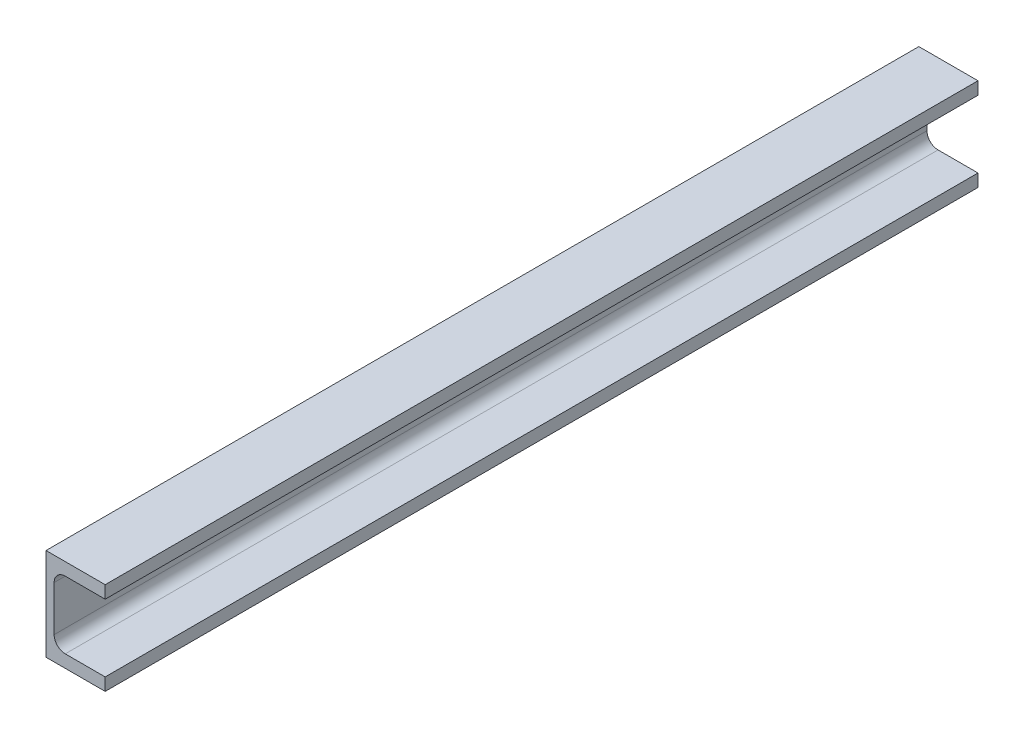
ISO-10303-21;
HEADER;
FILE_DESCRIPTION(('STEP AP214'),'2;1');
FILE_NAME('part.step','',(''),(''),'','','');
FILE_SCHEMA(('AUTOMOTIVE_DESIGN { 1 0 10303 214 1 1 1 1 }'));
ENDSEC;
DATA;
#1=APPLICATION_CONTEXT('core data for automotive mechanical design processes');
#2=APPLICATION_PROTOCOL_DEFINITION('international standard','automotive_design',2000,#1);
#3=PRODUCT_CONTEXT('',#1,'mechanical');
#4=PRODUCT('Part','Part','',(#3));
#5=PRODUCT_RELATED_PRODUCT_CATEGORY('part','',(#4));
#6=PRODUCT_DEFINITION_FORMATION('','',#4);
#7=PRODUCT_DEFINITION_CONTEXT('part definition',#1,'design');
#8=PRODUCT_DEFINITION('design','',#6,#7);
#9=PRODUCT_DEFINITION_SHAPE('','',#8);
#10=(LENGTH_UNIT() NAMED_UNIT(*) SI_UNIT(.MILLI.,.METRE.));
#11=(NAMED_UNIT(*) PLANE_ANGLE_UNIT() SI_UNIT($,.RADIAN.));
#12=(NAMED_UNIT(*) SI_UNIT($,.STERADIAN.) SOLID_ANGLE_UNIT());
#13=UNCERTAINTY_MEASURE_WITH_UNIT(LENGTH_MEASURE(1.E-05),#10,'distance_accuracy_value','');
#14=(GEOMETRIC_REPRESENTATION_CONTEXT(3) GLOBAL_UNCERTAINTY_ASSIGNED_CONTEXT((#13)) GLOBAL_UNIT_ASSIGNED_CONTEXT((#10,
#11,#12)) REPRESENTATION_CONTEXT('',''));
#15=CARTESIAN_POINT('',(0.,0.,0.));
#16=DIRECTION('',(0.,0.,1.));
#17=DIRECTION('',(1.,0.,0.));
#18=AXIS2_PLACEMENT_3D('',#15,#16,#17);
#19=CARTESIAN_POINT('',(-5.60000000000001,12.2,236.));
#20=DIRECTION('',(0.,0.,-1.));
#21=DIRECTION('',(-1.,0.,0.));
#22=AXIS2_PLACEMENT_3D('',#19,#20,#21);
#23=CYLINDRICAL_SURFACE('',#22,6.);
#24=CARTESIAN_POINT('',(-5.60000000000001,12.2,-236.));
#25=DIRECTION('',(0.,0.,-1.));
#26=DIRECTION('',(-1.,0.,0.));
#27=AXIS2_PLACEMENT_3D('',#24,#25,#26);
#28=CIRCLE('',#27,6.);
#29=CARTESIAN_POINT('',(-11.6,12.2,-236.));
#30=VERTEX_POINT('',#29);
#31=CARTESIAN_POINT('',(-5.60000000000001,18.2,-236.));
#32=VERTEX_POINT('',#31);
#33=EDGE_CURVE('E151',#30,#32,#28,.T.);
#34=ORIENTED_EDGE('',*,*,#33,.T.);
#35=DIRECTION('',(0.,0.,-1.));
#36=VECTOR('',#35,1.);
#37=CARTESIAN_POINT('',(-5.60000000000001,18.2,236.));
#38=LINE('',#37,#36);
#39=CARTESIAN_POINT('',(-5.60000000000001,18.2,236.));
#40=VERTEX_POINT('',#39);
#41=EDGE_CURVE('E11',#40,#32,#38,.T.);
#42=ORIENTED_EDGE('',*,*,#41,.F.);
#43=CARTESIAN_POINT('',(-5.60000000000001,12.2,236.));
#44=DIRECTION('',(0.,0.,-1.));
#45=DIRECTION('',(-1.,0.,0.));
#46=AXIS2_PLACEMENT_3D('',#43,#44,#45);
#47=CIRCLE('',#46,6.);
#48=CARTESIAN_POINT('',(-11.6,12.2,236.));
#49=VERTEX_POINT('',#48);
#50=EDGE_CURVE('E167',#49,#40,#47,.T.);
#51=ORIENTED_EDGE('',*,*,#50,.F.);
#52=DIRECTION('',(0.,0.,-1.));
#53=VECTOR('',#52,1.);
#54=CARTESIAN_POINT('',(-11.6,12.2,236.));
#55=LINE('',#54,#53);
#56=EDGE_CURVE('E146',#49,#30,#55,.T.);
#57=ORIENTED_EDGE('',*,*,#56,.T.);
#58=EDGE_LOOP('',(#34,#42,#51,#57));
#59=FACE_BOUND('',#58,.T.);
#60=ADVANCED_FACE('F43',(#59),#23,.F.);
#61=CARTESIAN_POINT('',(16.,18.2,236.));
#62=DIRECTION('',(0.,1.,0.));
#63=DIRECTION('',(0.,0.,1.));
#64=AXIS2_PLACEMENT_3D('',#61,#62,#63);
#65=PLANE('',#64);
#66=DIRECTION('',(1.,0.,0.));
#67=VECTOR('',#66,1.);
#68=CARTESIAN_POINT('',(16.,18.2,-236.));
#69=LINE('',#68,#67);
#70=CARTESIAN_POINT('',(16.,18.2,-236.));
#71=VERTEX_POINT('',#70);
#72=EDGE_CURVE('E153',#32,#71,#69,.T.);
#73=ORIENTED_EDGE('',*,*,#72,.T.);
#74=DIRECTION('',(0.,0.,-1.));
#75=VECTOR('',#74,1.);
#76=CARTESIAN_POINT('',(16.,18.2,236.));
#77=LINE('',#76,#75);
#78=CARTESIAN_POINT('',(16.,18.2,236.));
#79=VERTEX_POINT('',#78);
#80=EDGE_CURVE('E51',#79,#71,#77,.T.);
#81=ORIENTED_EDGE('',*,*,#80,.F.);
#82=DIRECTION('',(1.,0.,0.));
#83=VECTOR('',#82,1.);
#84=CARTESIAN_POINT('',(16.,18.2,236.));
#85=LINE('',#84,#83);
#86=EDGE_CURVE('E108',#40,#79,#85,.T.);
#87=ORIENTED_EDGE('',*,*,#86,.F.);
#88=ORIENTED_EDGE('',*,*,#41,.T.);
#89=EDGE_LOOP('',(#73,#81,#87,#88));
#90=FACE_BOUND('',#89,.T.);
#91=ADVANCED_FACE('F237',(#90),#65,.F.);
#92=CARTESIAN_POINT('',(16.,25.,236.));
#93=DIRECTION('',(-1.,0.,0.));
#94=DIRECTION('',(0.,0.,1.));
#95=AXIS2_PLACEMENT_3D('',#92,#93,#94);
#96=PLANE('',#95);
#97=DIRECTION('',(0.,1.,0.));
#98=VECTOR('',#97,1.);
#99=CARTESIAN_POINT('',(16.,25.,-236.));
#100=LINE('',#99,#98);
#101=CARTESIAN_POINT('',(16.,25.,-236.));
#102=VERTEX_POINT('',#101);
#103=EDGE_CURVE('E159',#71,#102,#100,.T.);
#104=ORIENTED_EDGE('',*,*,#103,.T.);
#105=DIRECTION('',(0.,0.,-1.));
#106=VECTOR('',#105,1.);
#107=CARTESIAN_POINT('',(16.,25.,236.));
#108=LINE('',#107,#106);
#109=CARTESIAN_POINT('',(16.,25.,236.));
#110=VERTEX_POINT('',#109);
#111=EDGE_CURVE('E182',#110,#102,#108,.T.);
#112=ORIENTED_EDGE('',*,*,#111,.F.);
#113=DIRECTION('',(0.,1.,0.));
#114=VECTOR('',#113,1.);
#115=CARTESIAN_POINT('',(16.,25.,236.));
#116=LINE('',#115,#114);
#117=EDGE_CURVE('E194',#79,#110,#116,.T.);
#118=ORIENTED_EDGE('',*,*,#117,.F.);
#119=ORIENTED_EDGE('',*,*,#80,.T.);
#120=EDGE_LOOP('',(#104,#112,#118,#119));
#121=FACE_BOUND('',#120,.T.);
#122=ADVANCED_FACE('F186',(#121),#96,.F.);
#123=CARTESIAN_POINT('',(-16.,25.,236.));
#124=DIRECTION('',(0.,-1.,0.));
#125=DIRECTION('',(0.,0.,-1.));
#126=AXIS2_PLACEMENT_3D('',#123,#124,#125);
#127=PLANE('',#126);
#128=DIRECTION('',(-1.,0.,0.));
#129=VECTOR('',#128,1.);
#130=CARTESIAN_POINT('',(-16.,25.,-236.));
#131=LINE('',#130,#129);
#132=CARTESIAN_POINT('',(-16.,25.,-236.));
#133=VERTEX_POINT('',#132);
#134=EDGE_CURVE('E156',#102,#133,#131,.T.);
#135=ORIENTED_EDGE('',*,*,#134,.T.);
#136=DIRECTION('',(0.,0.,-1.));
#137=VECTOR('',#136,1.);
#138=CARTESIAN_POINT('',(-16.,25.,236.));
#139=LINE('',#138,#137);
#140=CARTESIAN_POINT('',(-16.,25.,236.));
#141=VERTEX_POINT('',#140);
#142=EDGE_CURVE('E179',#141,#133,#139,.T.);
#143=ORIENTED_EDGE('',*,*,#142,.F.);
#144=DIRECTION('',(-1.,0.,0.));
#145=VECTOR('',#144,1.);
#146=CARTESIAN_POINT('',(-16.,25.,236.));
#147=LINE('',#146,#145);
#148=EDGE_CURVE('E209',#110,#141,#147,.T.);
#149=ORIENTED_EDGE('',*,*,#148,.F.);
#150=ORIENTED_EDGE('',*,*,#111,.T.);
#151=EDGE_LOOP('',(#135,#143,#149,#150));
#152=FACE_BOUND('',#151,.T.);
#153=ADVANCED_FACE('F197',(#152),#127,.F.);
#154=CARTESIAN_POINT('',(-16.,25.,236.));
#155=DIRECTION('',(1.,0.,0.));
#156=DIRECTION('',(0.,0.,-1.));
#157=AXIS2_PLACEMENT_3D('',#154,#155,#156);
#158=PLANE('',#157);
#159=CARTESIAN_POINT('',(-16.,0.,-226.));
#160=DIRECTION('',(1.,0.,0.));
#161=DIRECTION('',(0.,0.,-1.));
#162=AXIS2_PLACEMENT_3D('',#159,#160,#161);
#163=CIRCLE('',#162,3.99999999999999);
#164=CARTESIAN_POINT('',(-16.,0.,-230.));
#165=VERTEX_POINT('',#164);
#166=EDGE_CURVE('E155',#165,#165,#163,.T.);
#167=ORIENTED_EDGE('',*,*,#166,.T.);
#168=EDGE_LOOP('',(#167));
#169=FACE_BOUND('',#168,.T.);
#170=DIRECTION('',(0.,-1.,0.));
#171=VECTOR('',#170,1.);
#172=CARTESIAN_POINT('',(-16.,25.,-236.));
#173=LINE('',#172,#171);
#174=CARTESIAN_POINT('',(-16.,-25.,-236.));
#175=VERTEX_POINT('',#174);
#176=EDGE_CURVE('E163',#133,#175,#173,.T.);
#177=ORIENTED_EDGE('',*,*,#176,.T.);
#178=DIRECTION('',(0.,0.,-1.));
#179=VECTOR('',#178,1.);
#180=CARTESIAN_POINT('',(-16.,-25.,236.));
#181=LINE('',#180,#179);
#182=CARTESIAN_POINT('',(-16.,-25.,236.));
#183=VERTEX_POINT('',#182);
#184=EDGE_CURVE('E180',#183,#175,#181,.T.);
#185=ORIENTED_EDGE('',*,*,#184,.F.);
#186=DIRECTION('',(0.,-1.,0.));
#187=VECTOR('',#186,1.);
#188=CARTESIAN_POINT('',(-16.,25.,236.));
#189=LINE('',#188,#187);
#190=EDGE_CURVE('E207',#141,#183,#189,.T.);
#191=ORIENTED_EDGE('',*,*,#190,.F.);
#192=ORIENTED_EDGE('',*,*,#142,.T.);
#193=EDGE_LOOP('',(#177,#185,#191,#192));
#194=FACE_BOUND('',#193,.T.);
#195=ADVANCED_FACE('F202',(#169,#194),#158,.F.);
#196=CARTESIAN_POINT('',(-16.,-25.,236.));
#197=DIRECTION('',(0.,1.,0.));
#198=DIRECTION('',(0.,0.,1.));
#199=AXIS2_PLACEMENT_3D('',#196,#197,#198);
#200=PLANE('',#199);
#201=DIRECTION('',(1.,0.,0.));
#202=VECTOR('',#201,1.);
#203=CARTESIAN_POINT('',(-16.,-25.,-236.));
#204=LINE('',#203,#202);
#205=CARTESIAN_POINT('',(16.,-25.,-236.));
#206=VERTEX_POINT('',#205);
#207=EDGE_CURVE('E161',#175,#206,#204,.T.);
#208=ORIENTED_EDGE('',*,*,#207,.T.);
#209=DIRECTION('',(0.,0.,-1.));
#210=VECTOR('',#209,1.);
#211=CARTESIAN_POINT('',(16.,-25.,236.));
#212=LINE('',#211,#210);
#213=CARTESIAN_POINT('',(16.,-25.,236.));
#214=VERTEX_POINT('',#213);
#215=EDGE_CURVE('E172',#214,#206,#212,.T.);
#216=ORIENTED_EDGE('',*,*,#215,.F.);
#217=DIRECTION('',(1.,0.,0.));
#218=VECTOR('',#217,1.);
#219=CARTESIAN_POINT('',(-16.,-25.,236.));
#220=LINE('',#219,#218);
#221=EDGE_CURVE('E206',#183,#214,#220,.T.);
#222=ORIENTED_EDGE('',*,*,#221,.F.);
#223=ORIENTED_EDGE('',*,*,#184,.T.);
#224=EDGE_LOOP('',(#208,#216,#222,#223));
#225=FACE_BOUND('',#224,.T.);
#226=ADVANCED_FACE('F252',(#225),#200,.F.);
#227=CARTESIAN_POINT('',(16.,-18.2,236.));
#228=DIRECTION('',(-1.,0.,0.));
#229=DIRECTION('',(0.,0.,1.));
#230=AXIS2_PLACEMENT_3D('',#227,#228,#229);
#231=PLANE('',#230);
#232=DIRECTION('',(0.,1.,0.));
#233=VECTOR('',#232,1.);
#234=CARTESIAN_POINT('',(16.,-18.2,-236.));
#235=LINE('',#234,#233);
#236=CARTESIAN_POINT('',(16.,-18.2,-236.));
#237=VERTEX_POINT('',#236);
#238=EDGE_CURVE('E164',#206,#237,#235,.T.);
#239=ORIENTED_EDGE('',*,*,#238,.T.);
#240=DIRECTION('',(0.,0.,-1.));
#241=VECTOR('',#240,1.);
#242=CARTESIAN_POINT('',(16.,-18.2,236.));
#243=LINE('',#242,#241);
#244=CARTESIAN_POINT('',(16.,-18.2,236.));
#245=VERTEX_POINT('',#244);
#246=EDGE_CURVE('E145',#245,#237,#243,.T.);
#247=ORIENTED_EDGE('',*,*,#246,.F.);
#248=DIRECTION('',(0.,1.,0.));
#249=VECTOR('',#248,1.);
#250=CARTESIAN_POINT('',(16.,-18.2,236.));
#251=LINE('',#250,#249);
#252=EDGE_CURVE('E131',#214,#245,#251,.T.);
#253=ORIENTED_EDGE('',*,*,#252,.F.);
#254=ORIENTED_EDGE('',*,*,#215,.T.);
#255=EDGE_LOOP('',(#239,#247,#253,#254));
#256=FACE_BOUND('',#255,.T.);
#257=ADVANCED_FACE('F247',(#256),#231,.F.);
#258=CARTESIAN_POINT('',(-5.60000000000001,-18.2,236.));
#259=DIRECTION('',(0.,-1.,0.));
#260=DIRECTION('',(0.,0.,-1.));
#261=AXIS2_PLACEMENT_3D('',#258,#259,#260);
#262=PLANE('',#261);
#263=DIRECTION('',(-1.,0.,0.));
#264=VECTOR('',#263,1.);
#265=CARTESIAN_POINT('',(-5.60000000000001,-18.2,-236.));
#266=LINE('',#265,#264);
#267=CARTESIAN_POINT('',(-5.60000000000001,-18.2,-236.));
#268=VERTEX_POINT('',#267);
#269=EDGE_CURVE('E142',#237,#268,#266,.T.);
#270=ORIENTED_EDGE('',*,*,#269,.T.);
#271=DIRECTION('',(0.,0.,-1.));
#272=VECTOR('',#271,1.);
#273=CARTESIAN_POINT('',(-5.60000000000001,-18.2,236.));
#274=LINE('',#273,#272);
#275=CARTESIAN_POINT('',(-5.60000000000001,-18.2,236.));
#276=VERTEX_POINT('',#275);
#277=EDGE_CURVE('E136',#276,#268,#274,.T.);
#278=ORIENTED_EDGE('',*,*,#277,.F.);
#279=DIRECTION('',(-1.,0.,0.));
#280=VECTOR('',#279,1.);
#281=CARTESIAN_POINT('',(-5.60000000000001,-18.2,236.));
#282=LINE('',#281,#280);
#283=EDGE_CURVE('E126',#245,#276,#282,.T.);
#284=ORIENTED_EDGE('',*,*,#283,.F.);
#285=ORIENTED_EDGE('',*,*,#246,.T.);
#286=EDGE_LOOP('',(#270,#278,#284,#285));
#287=FACE_BOUND('',#286,.T.);
#288=ADVANCED_FACE('F137',(#287),#262,.F.);
#289=CARTESIAN_POINT('',(-5.60000000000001,-12.2,236.));
#290=DIRECTION('',(0.,0.,-1.));
#291=DIRECTION('',(-1.,0.,0.));
#292=AXIS2_PLACEMENT_3D('',#289,#290,#291);
#293=CYLINDRICAL_SURFACE('',#292,6.);
#294=CARTESIAN_POINT('',(-5.60000000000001,-12.2,-236.));
#295=DIRECTION('',(0.,0.,-1.));
#296=DIRECTION('',(1.,0.,0.));
#297=AXIS2_PLACEMENT_3D('',#294,#295,#296);
#298=CIRCLE('',#297,6.);
#299=CARTESIAN_POINT('',(-11.6,-12.2,-236.));
#300=VERTEX_POINT('',#299);
#301=EDGE_CURVE('E91',#268,#300,#298,.T.);
#302=ORIENTED_EDGE('',*,*,#301,.T.);
#303=DIRECTION('',(0.,0.,-1.));
#304=VECTOR('',#303,1.);
#305=CARTESIAN_POINT('',(-11.6,-12.2,236.));
#306=LINE('',#305,#304);
#307=CARTESIAN_POINT('',(-11.6,-12.2,236.));
#308=VERTEX_POINT('',#307);
#309=EDGE_CURVE('E141',#308,#300,#306,.T.);
#310=ORIENTED_EDGE('',*,*,#309,.F.);
#311=CARTESIAN_POINT('',(-5.60000000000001,-12.2,236.));
#312=DIRECTION('',(0.,0.,-1.));
#313=DIRECTION('',(1.,0.,0.));
#314=AXIS2_PLACEMENT_3D('',#311,#312,#313);
#315=CIRCLE('',#314,6.);
#316=EDGE_CURVE('E133',#276,#308,#315,.T.);
#317=ORIENTED_EDGE('',*,*,#316,.F.);
#318=ORIENTED_EDGE('',*,*,#277,.T.);
#319=EDGE_LOOP('',(#302,#310,#317,#318));
#320=FACE_BOUND('',#319,.T.);
#321=ADVANCED_FACE('F143',(#320),#293,.F.);
#322=CARTESIAN_POINT('',(-11.6,12.2,236.));
#323=DIRECTION('',(-1.,0.,0.));
#324=DIRECTION('',(0.,0.,1.));
#325=AXIS2_PLACEMENT_3D('',#322,#323,#324);
#326=PLANE('',#325);
#327=CARTESIAN_POINT('',(-11.6,0.,-226.));
#328=DIRECTION('',(1.,0.,0.));
#329=DIRECTION('',(0.,0.,-1.));
#330=AXIS2_PLACEMENT_3D('',#327,#328,#329);
#331=CIRCLE('',#330,3.99999999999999);
#332=CARTESIAN_POINT('',(-11.6,0.,-230.));
#333=VERTEX_POINT('',#332);
#334=EDGE_CURVE('E218',#333,#333,#331,.T.);
#335=ORIENTED_EDGE('',*,*,#334,.F.);
#336=EDGE_LOOP('',(#335));
#337=FACE_BOUND('',#336,.T.);
#338=DIRECTION('',(0.,1.,0.));
#339=VECTOR('',#338,1.);
#340=CARTESIAN_POINT('',(-11.6,12.2,-236.));
#341=LINE('',#340,#339);
#342=EDGE_CURVE('E99',#300,#30,#341,.T.);
#343=ORIENTED_EDGE('',*,*,#342,.T.);
#344=ORIENTED_EDGE('',*,*,#56,.F.);
#345=DIRECTION('',(0.,1.,0.));
#346=VECTOR('',#345,1.);
#347=CARTESIAN_POINT('',(-11.6,12.2,236.));
#348=LINE('',#347,#346);
#349=EDGE_CURVE('E56',#308,#49,#348,.T.);
#350=ORIENTED_EDGE('',*,*,#349,.F.);
#351=ORIENTED_EDGE('',*,*,#309,.T.);
#352=EDGE_LOOP('',(#343,#344,#350,#351));
#353=FACE_BOUND('',#352,.T.);
#354=ADVANCED_FACE('F228',(#337,#353),#326,.F.);
#355=CARTESIAN_POINT('',(-5.60000000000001,12.2,236.));
#356=DIRECTION('',(0.,0.,-1.));
#357=DIRECTION('',(-1.,0.,0.));
#358=AXIS2_PLACEMENT_3D('',#355,#356,#357);
#359=PLANE('',#358);
#360=ORIENTED_EDGE('',*,*,#50,.T.);
#361=ORIENTED_EDGE('',*,*,#86,.T.);
#362=ORIENTED_EDGE('',*,*,#117,.T.);
#363=ORIENTED_EDGE('',*,*,#148,.T.);
#364=ORIENTED_EDGE('',*,*,#190,.T.);
#365=ORIENTED_EDGE('',*,*,#221,.T.);
#366=ORIENTED_EDGE('',*,*,#252,.T.);
#367=ORIENTED_EDGE('',*,*,#283,.T.);
#368=ORIENTED_EDGE('',*,*,#316,.T.);
#369=ORIENTED_EDGE('',*,*,#349,.T.);
#370=EDGE_LOOP('',(#360,#361,#362,#363,#364,#365,#366,#367,#368,#369));
#371=FACE_BOUND('',#370,.T.);
#372=ADVANCED_FACE('F128',(#371),#359,.F.);
#373=CARTESIAN_POINT('',(-5.60000000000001,12.2,-236.));
#374=DIRECTION('',(0.,0.,-1.));
#375=DIRECTION('',(-1.,0.,0.));
#376=AXIS2_PLACEMENT_3D('',#373,#374,#375);
#377=PLANE('',#376);
#378=ORIENTED_EDGE('',*,*,#33,.F.);
#379=ORIENTED_EDGE('',*,*,#342,.F.);
#380=ORIENTED_EDGE('',*,*,#301,.F.);
#381=ORIENTED_EDGE('',*,*,#269,.F.);
#382=ORIENTED_EDGE('',*,*,#238,.F.);
#383=ORIENTED_EDGE('',*,*,#207,.F.);
#384=ORIENTED_EDGE('',*,*,#176,.F.);
#385=ORIENTED_EDGE('',*,*,#134,.F.);
#386=ORIENTED_EDGE('',*,*,#103,.F.);
#387=ORIENTED_EDGE('',*,*,#72,.F.);
#388=EDGE_LOOP('',(#378,#379,#380,#381,#382,#383,#384,#385,#386,#387));
#389=FACE_BOUND('',#388,.T.);
#390=ADVANCED_FACE('F192',(#389),#377,.T.);
#391=CARTESIAN_POINT('',(-25.1,0.,-226.));
#392=DIRECTION('',(1.,0.,0.));
#393=DIRECTION('',(0.,0.,-1.));
#394=AXIS2_PLACEMENT_3D('',#391,#392,#393);
#395=CYLINDRICAL_SURFACE('',#394,3.99999999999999);
#396=ORIENTED_EDGE('',*,*,#334,.T.);
#397=EDGE_LOOP('',(#396));
#398=FACE_BOUND('',#397,.T.);
#399=ORIENTED_EDGE('',*,*,#166,.F.);
#400=EDGE_LOOP('',(#399));
#401=FACE_BOUND('',#400,.T.);
#402=ADVANCED_FACE('F225',(#398,#401),#395,.F.);
#403=CLOSED_SHELL('',(#60,#91,#122,#153,#195,#226,#257,#288,#321,#354,#372,#390,#402));
#404=MANIFOLD_SOLID_BREP('B2',#403);
#405=ADVANCED_BREP_SHAPE_REPRESENTATION('',(#18,#404),#14);
#406=SHAPE_DEFINITION_REPRESENTATION(#9,#405);
ENDSEC;
END-ISO-10303-21;
